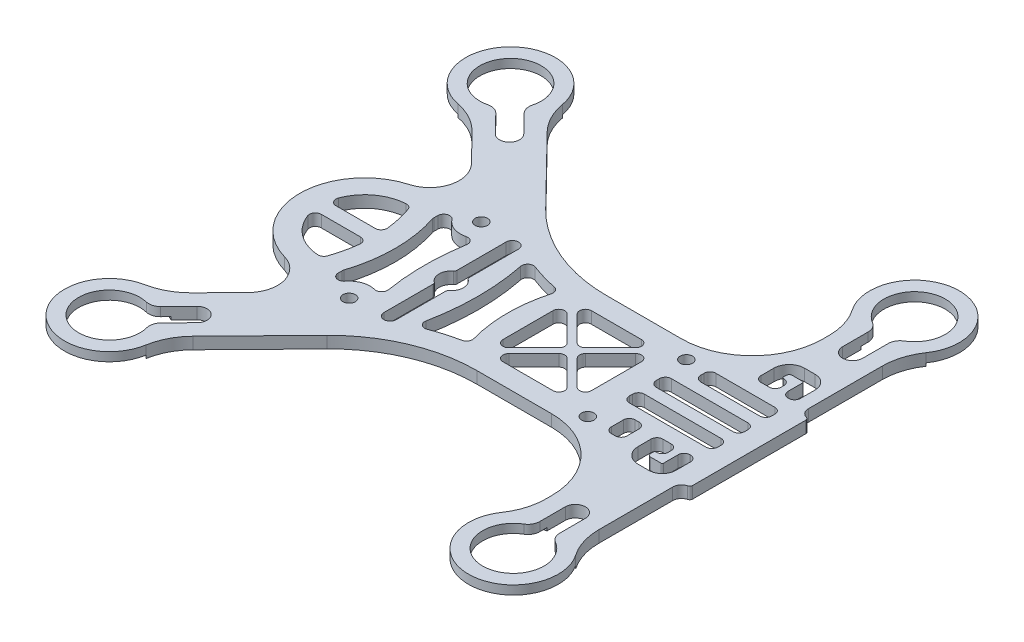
from build123d import *

# Parameters (mm, degrees)
ESQUISSE1_R             = 1.05
BOSS_EXTRU_1_DEPTH      = 2
ESQUISSE3_R             = 7.6
ENL_V_MAT_EXTRU_2_DEPTH = 0.5


with BuildPart() as part:
    # Esquisse1 → Boss.-Extru.1 (new body)
    with BuildSketch(Plane(origin=(0, 0, 0), x_dir=(1, 0, 0), z_dir=(0, 1, 0))):
        with BuildLine():
            Line((1810.142378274, 1227.688596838), (1821.387711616, 1216.191951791))
            ThreePointArc((1821.387711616, 1216.191951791), (1829.565086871, 1210.629428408), (1839.259638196, 1208.67320576))
            Line((1839.259638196, 1208.67320576), (1851.929794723, 1208.67320576))
            ThreePointArc((1851.929794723, 1208.67320576), (1860.415076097, 1212.187924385), (1863.929794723, 1220.67320576))
            Line((1863.929794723, 1220.67320576), (1863.929794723, 1221.697735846))
            ThreePointArc((1863.929794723, 1221.697735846), (1863.479306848, 1224.665364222), (1862.168431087, 1227.365616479))
            ThreePointArc((1862.168431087, 1227.365616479), (1868.429794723, 1239.27320576), (1874.691158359, 1227.365616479))
            ThreePointArc((1874.691158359, 1227.365616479), (1873.380282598, 1224.665364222), (1872.929794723, 1221.697735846))
            Line((1872.929794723, 1221.697735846), (1872.929794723, 1209.17320576))
            ThreePointArc((1872.929794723, 1209.17320576), (1873.235869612, 1208.265162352), (1874.029185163, 1207.727691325))
            ThreePointArc((1874.029185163, 1207.727691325), (1874.293623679, 1207.548534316), (1874.395648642, 1207.24585318))
            Line((1874.395648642, 1207.24585318), (1874.395648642, 1197.67320576))
            Line((1874.395648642, 1197.67320576), (1874.395648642, 1188.100558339))
            ThreePointArc((1874.395648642, 1188.100558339), (1874.293623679, 1187.797877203), (1874.029185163, 1187.618720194))
            ThreePointArc((1874.029185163, 1187.618720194), (1873.235869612, 1187.081249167), (1872.929794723, 1186.17320576))
            Line((1872.929794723, 1186.17320576), (1872.929794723, 1173.648675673))
            ThreePointArc((1872.929794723, 1173.648675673), (1873.380282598, 1170.681047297), (1874.691158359, 1167.98079504))
            ThreePointArc((1874.691158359, 1167.98079504), (1868.429794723, 1156.07320576), (1862.168431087, 1167.98079504))
            ThreePointArc((1862.168431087, 1167.98079504), (1863.479306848, 1170.681047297), (1863.929794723, 1173.648675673))
            Line((1863.929794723, 1173.648675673), (1863.929794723, 1174.67320576))
            ThreePointArc((1863.929794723, 1174.67320576), (1860.415076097, 1183.158487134), (1851.929794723, 1186.67320576))
            Line((1851.929794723, 1186.67320576), (1839.259638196, 1186.67320576))
            ThreePointArc((1839.259638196, 1186.67320576), (1829.565086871, 1184.716983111), (1821.387711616, 1179.154459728))
            Line((1821.387711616, 1179.154459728), (1810.142378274, 1167.657814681))
            ThreePointArc((1810.142378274, 1167.657814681), (1808.389307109, 1165.221321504), (1807.438270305, 1162.374343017))
            ThreePointArc((1807.438270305, 1162.374343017), (1794.635781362, 1158.240140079), (1798.486059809, 1171.130862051))
            ThreePointArc((1798.486059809, 1171.130862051), (1801.311326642, 1172.14458037), (1803.708484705, 1173.95106611))
            Line((1803.708484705, 1173.95106611), (1808.433485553, 1178.781661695))
            ThreePointArc((1808.433485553, 1178.781661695), (1809.690637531, 1183.564865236), (1806.220716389, 1187.088941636))
            ThreePointArc((1806.220716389, 1187.088941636), (1798.216271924, 1197.67320576), (1806.220716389, 1208.257469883))
            ThreePointArc((1806.220716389, 1208.257469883), (1809.690637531, 1211.781546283), (1808.433485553, 1216.564749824))
            Line((1808.433485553, 1216.564749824), (1803.708484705, 1221.395345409))
            ThreePointArc((1803.708484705, 1221.395345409), (1801.311326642, 1223.201831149), (1798.486059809, 1224.215549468))
            ThreePointArc((1798.486059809, 1224.215549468), (1794.635781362, 1237.10627144), (1807.438270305, 1232.972068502))
            ThreePointArc((1807.438270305, 1232.972068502), (1808.389307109, 1230.125090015), (1810.142378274, 1227.688596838))
        make_face()
        with Locations(Location((1855.395648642, 1189.32320576, 0), (0, 0, 270))):
            Circle(ESQUISSE1_R, mode=Mode.SUBTRACT)
        with Locations(Location((1855.395648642, 1206.02320576, 0), (0, 0, 270))):
            Circle(ESQUISSE1_R, mode=Mode.SUBTRACT)
        with Locations(Location((1817.795648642, 1186.47320576, 0), (0, 0, 270))):
            Circle(ESQUISSE1_R, mode=Mode.SUBTRACT)
        with Locations(Location((1817.795648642, 1208.87320576, 0), (0, 0, 270))):
            Circle(ESQUISSE1_R, mode=Mode.SUBTRACT)
        with BuildLine():
            Line((1870.129794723, 1169.849774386), (1870.129794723, 1174.17320576))
            ThreePointArc((1870.129794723, 1174.17320576), (1868.429794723, 1175.87320576), (1866.729794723, 1174.17320576))
            Line((1866.729794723, 1174.17320576), (1866.729794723, 1169.849774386))
            ThreePointArc((1866.729794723, 1169.849774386), (1866.469845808, 1168.863761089), (1865.757572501, 1168.134060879))
            ThreePointArc((1865.757572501, 1168.134060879), (1868.429794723, 1158.47320576), (1871.102016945, 1168.134060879))
            ThreePointArc((1871.102016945, 1168.134060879), (1870.389743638, 1168.863761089), (1870.129794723, 1169.849774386))
        make_face(mode=Mode.SUBTRACT)
        with BuildLine():
            Line((1803.053758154, 1169.27741827), (1806.076918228, 1172.368140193))
            ThreePointArc((1806.076918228, 1172.368140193), (1808.480934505, 1172.394705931), (1808.507500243, 1169.990689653))
            Line((1808.507500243, 1169.990689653), (1805.484340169, 1166.89996773))
            ThreePointArc((1805.484340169, 1166.89996773), (1804.980701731, 1166.01332012), (1804.979646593, 1164.993616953))
            ThreePointArc((1804.979646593, 1164.993616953), (1796.313981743, 1159.955845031), (1801.159025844, 1168.73072058))
            ThreePointArc((1801.159025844, 1168.73072058), (1802.178456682, 1168.7543093), (1803.053758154, 1169.27741827))
        make_face(mode=Mode.SUBTRACT)
        with BuildLine():
            Line((1870.129794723, 1225.496637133), (1870.129794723, 1221.17320576))
            ThreePointArc((1870.129794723, 1221.17320576), (1868.429794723, 1219.47320576), (1866.729794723, 1221.17320576))
            Line((1866.729794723, 1221.17320576), (1866.729794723, 1225.496637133))
            ThreePointArc((1866.729794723, 1225.496637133), (1866.469845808, 1226.48265043), (1865.757572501, 1227.21235064))
            ThreePointArc((1865.757572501, 1227.21235064), (1868.429794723, 1236.87320576), (1871.102016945, 1227.21235064))
            ThreePointArc((1871.102016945, 1227.21235064), (1870.389743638, 1226.48265043), (1870.129794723, 1225.496637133))
        make_face(mode=Mode.SUBTRACT)
        with BuildLine():
            Line((1803.053758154, 1226.068993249), (1806.076918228, 1222.978271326))
            ThreePointArc((1806.076918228, 1222.978271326), (1808.480934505, 1222.951705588), (1808.507500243, 1225.355721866))
            Line((1808.507500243, 1225.355721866), (1805.484340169, 1228.446443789))
            ThreePointArc((1805.484340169, 1228.446443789), (1804.980701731, 1229.333091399), (1804.979646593, 1230.352794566))
            ThreePointArc((1804.979646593, 1230.352794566), (1796.313981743, 1235.390566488), (1801.159025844, 1226.615690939))
            ThreePointArc((1801.159025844, 1226.615690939), (1802.178456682, 1226.592102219), (1803.053758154, 1226.068993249))
        make_face(mode=Mode.SUBTRACT)
        with BuildLine():
            Line((1864.056359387, 1212.190468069), (1864.056359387, 1210.007730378))
            ThreePointArc((1864.056359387, 1210.007730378), (1864.349252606, 1209.300623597), (1865.056359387, 1209.007730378))
            Line((1865.056359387, 1209.007730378), (1866.456359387, 1209.007730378))
            ThreePointArc((1866.456359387, 1209.007730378), (1867.163466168, 1209.300623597), (1867.456359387, 1210.007730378))
            Line((1867.456359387, 1210.007730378), (1867.456359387, 1210.490468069))
            ThreePointArc((1867.456359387, 1210.490468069), (1867.163466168, 1211.19757485), (1866.456359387, 1211.490468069))
            Line((1866.456359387, 1211.490468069), (1866.356359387, 1211.490468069))
            ThreePointArc((1866.356359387, 1211.490468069), (1866.214938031, 1211.549046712), (1866.156359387, 1211.690468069))
            Line((1866.156359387, 1211.690468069), (1866.156359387, 1212.190468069))
            ThreePointArc((1866.156359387, 1212.190468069), (1866.302805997, 1212.544021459), (1866.656359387, 1212.690468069))
            Line((1866.656359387, 1212.690468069), (1868.456359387, 1212.690468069))
            ThreePointArc((1868.456359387, 1212.690468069), (1868.597780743, 1212.631889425), (1868.656359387, 1212.490468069))
            Line((1868.656359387, 1212.490468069), (1868.656359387, 1210.007730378))
            ThreePointArc((1868.656359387, 1210.007730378), (1868.949252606, 1209.300623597), (1869.656359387, 1209.007730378))
            Line((1869.656359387, 1209.007730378), (1869.756359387, 1209.007730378))
            ThreePointArc((1869.756359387, 1209.007730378), (1870.463466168, 1209.300623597), (1870.756359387, 1210.007730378))
            Line((1870.756359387, 1210.007730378), (1870.756359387, 1212.490468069))
            ThreePointArc((1870.756359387, 1212.490468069), (1870.082704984, 1214.116813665), (1868.456359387, 1214.790468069))
            Line((1868.456359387, 1214.790468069), (1866.656359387, 1214.790468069))
            ThreePointArc((1866.656359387, 1214.790468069), (1864.817881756, 1214.0289457), (1864.056359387, 1212.190468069))
        make_face(mode=Mode.SUBTRACT)
        with BuildLine():
            Line((1864.056359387, 1189.190468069), (1864.056359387, 1191.37320576))
            ThreePointArc((1864.056359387, 1191.37320576), (1864.349252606, 1192.080312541), (1865.056359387, 1192.37320576))
            Line((1865.056359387, 1192.37320576), (1866.456359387, 1192.37320576))
            ThreePointArc((1866.456359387, 1192.37320576), (1867.163466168, 1192.080312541), (1867.456359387, 1191.37320576))
            Line((1867.456359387, 1191.37320576), (1867.456359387, 1190.890468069))
            ThreePointArc((1867.456359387, 1190.890468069), (1867.163466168, 1190.183361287), (1866.456359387, 1189.890468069))
            Line((1866.456359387, 1189.890468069), (1866.356359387, 1189.890468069))
            ThreePointArc((1866.356359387, 1189.890468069), (1866.214938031, 1189.831889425), (1866.156359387, 1189.690468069))
            Line((1866.156359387, 1189.690468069), (1866.156359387, 1189.190468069))
            ThreePointArc((1866.156359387, 1189.190468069), (1866.302805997, 1188.836914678), (1866.656359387, 1188.690468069))
            Line((1866.656359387, 1188.690468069), (1868.456359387, 1188.690468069))
            ThreePointArc((1868.456359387, 1188.690468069), (1868.597780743, 1188.749046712), (1868.656359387, 1188.890468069))
            Line((1868.656359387, 1188.890468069), (1868.656359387, 1191.37320576))
            ThreePointArc((1868.656359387, 1191.37320576), (1868.949252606, 1192.080312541), (1869.656359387, 1192.37320576))
            Line((1869.656359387, 1192.37320576), (1869.756359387, 1192.37320576))
            ThreePointArc((1869.756359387, 1192.37320576), (1870.463466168, 1192.080312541), (1870.756359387, 1191.37320576))
            Line((1870.756359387, 1191.37320576), (1870.756359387, 1188.890468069))
            ThreePointArc((1870.756359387, 1188.890468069), (1870.082704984, 1187.264122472), (1868.456359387, 1186.590468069))
            Line((1868.456359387, 1186.590468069), (1866.656359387, 1186.590468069))
            ThreePointArc((1866.656359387, 1186.590468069), (1864.817881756, 1187.351990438), (1864.056359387, 1189.190468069))
        make_face(mode=Mode.SUBTRACT)
        with BuildLine():
            Line((1840.158390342, 1190.17320576), (1848.632906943, 1190.17320576))
            ThreePointArc((1848.632906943, 1190.17320576), (1849.556786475, 1190.790522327), (1849.340013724, 1191.880312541))
            Line((1849.340013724, 1191.880312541), (1845.102755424, 1196.117570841))
            ThreePointArc((1845.102755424, 1196.117570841), (1844.395648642, 1196.41046406), (1843.688541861, 1196.117570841))
            Line((1843.688541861, 1196.117570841), (1839.451283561, 1191.880312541))
            ThreePointArc((1839.451283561, 1191.880312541), (1839.23451081, 1190.790522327), (1840.158390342, 1190.17320576))
        make_face(mode=Mode.SUBTRACT)
        with BuildLine():
            Line((1850.188541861, 1192.728840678), (1845.951283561, 1196.966098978))
            ThreePointArc((1845.951283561, 1196.966098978), (1845.658390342, 1197.67320576), (1845.951283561, 1198.380312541))
            Line((1845.951283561, 1198.380312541), (1850.188541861, 1202.617570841))
            ThreePointArc((1850.188541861, 1202.617570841), (1851.278332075, 1202.834343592), (1851.895648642, 1201.91046406))
            Line((1851.895648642, 1201.91046406), (1851.895648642, 1193.435947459))
            ThreePointArc((1851.895648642, 1193.435947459), (1851.278332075, 1192.512067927), (1850.188541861, 1192.728840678))
        make_face(mode=Mode.SUBTRACT)
        with BuildLine():
            Line((1840.158390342, 1205.17320576), (1848.632906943, 1205.17320576))
            ThreePointArc((1848.632906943, 1205.17320576), (1849.556786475, 1204.555889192), (1849.340013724, 1203.466098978))
            Line((1849.340013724, 1203.466098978), (1845.102755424, 1199.228840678))
            ThreePointArc((1845.102755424, 1199.228840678), (1844.395648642, 1198.935947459), (1843.688541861, 1199.228840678))
            Line((1843.688541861, 1199.228840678), (1839.451283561, 1203.466098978))
            ThreePointArc((1839.451283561, 1203.466098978), (1839.23451081, 1204.555889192), (1840.158390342, 1205.17320576))
        make_face(mode=Mode.SUBTRACT)
        with BuildLine():
            Line((1838.602755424, 1192.728840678), (1842.840013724, 1196.966098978))
            ThreePointArc((1842.840013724, 1196.966098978), (1843.132906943, 1197.67320576), (1842.840013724, 1198.380312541))
            Line((1842.840013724, 1198.380312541), (1838.602755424, 1202.617570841))
            ThreePointArc((1838.602755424, 1202.617570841), (1837.51296521, 1202.834343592), (1836.895648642, 1201.91046406))
            Line((1836.895648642, 1201.91046406), (1836.895648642, 1193.435947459))
            ThreePointArc((1836.895648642, 1193.435947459), (1837.51296521, 1192.512067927), (1838.602755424, 1192.728840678))
        make_face(mode=Mode.SUBTRACT)
        with BuildLine():
            Line((1870.895648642, 1200.410468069), (1870.895648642, 1200.970468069))
            ThreePointArc((1870.895648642, 1200.970468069), (1870.602755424, 1201.67757485), (1869.895648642, 1201.970468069))
            Line((1869.895648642, 1201.970468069), (1856.895648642, 1201.970468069))
            ThreePointArc((1856.895648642, 1201.970468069), (1856.188541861, 1201.67757485), (1855.895648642, 1200.970468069))
            Line((1855.895648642, 1200.970468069), (1855.895648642, 1200.410468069))
            ThreePointArc((1855.895648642, 1200.410468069), (1856.188541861, 1199.703361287), (1856.895648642, 1199.410468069))
            Line((1856.895648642, 1199.410468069), (1869.895648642, 1199.410468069))
            ThreePointArc((1869.895648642, 1199.410468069), (1870.602755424, 1199.703361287), (1870.895648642, 1200.410468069))
        make_face(mode=Mode.SUBTRACT)
        with BuildLine():
            Line((1870.895648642, 1195.850468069), (1870.895648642, 1196.410468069))
            ThreePointArc((1870.895648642, 1196.410468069), (1870.602755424, 1197.11757485), (1869.895648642, 1197.410468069))
            Line((1869.895648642, 1197.410468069), (1856.895648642, 1197.410468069))
            ThreePointArc((1856.895648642, 1197.410468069), (1856.188541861, 1197.11757485), (1855.895648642, 1196.410468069))
            Line((1855.895648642, 1196.410468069), (1855.895648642, 1195.850468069))
            ThreePointArc((1855.895648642, 1195.850468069), (1856.188541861, 1195.143361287), (1856.895648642, 1194.850468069))
            Line((1856.895648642, 1194.850468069), (1869.895648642, 1194.850468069))
            ThreePointArc((1869.895648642, 1194.850468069), (1870.602755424, 1195.143361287), (1870.895648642, 1195.850468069))
        make_face(mode=Mode.SUBTRACT)
        with BuildLine():
            Line((1870.895648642, 1205.530468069), (1870.895648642, 1204.970468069))
            ThreePointArc((1870.895648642, 1204.970468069), (1870.602755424, 1204.263361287), (1869.895648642, 1203.970468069))
            Line((1869.895648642, 1203.970468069), (1859.895648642, 1203.970468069))
            ThreePointArc((1859.895648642, 1203.970468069), (1859.188541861, 1204.263361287), (1858.895648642, 1204.970468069))
            Line((1858.895648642, 1204.970468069), (1858.895648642, 1205.530468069))
            ThreePointArc((1858.895648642, 1205.530468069), (1859.188541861, 1206.23757485), (1859.895648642, 1206.530468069))
            Line((1859.895648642, 1206.530468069), (1869.895648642, 1206.530468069))
            ThreePointArc((1869.895648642, 1206.530468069), (1870.602755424, 1206.23757485), (1870.895648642, 1205.530468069))
        make_face(mode=Mode.SUBTRACT)
        with BuildLine():
            Line((1861.556359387, 1191.850468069), (1861.556359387, 1189.81594345))
            ThreePointArc((1861.556359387, 1189.81594345), (1861.263466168, 1189.108836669), (1860.556359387, 1188.81594345))
            Line((1860.556359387, 1188.81594345), (1859.895648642, 1188.81594345))
            ThreePointArc((1859.895648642, 1188.81594345), (1859.188541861, 1189.108836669), (1858.895648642, 1189.81594345))
            Line((1858.895648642, 1189.81594345), (1858.895648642, 1191.850468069))
            ThreePointArc((1858.895648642, 1191.850468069), (1859.188541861, 1192.55757485), (1859.895648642, 1192.850468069))
            Line((1859.895648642, 1192.850468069), (1860.556359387, 1192.850468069))
            ThreePointArc((1860.556359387, 1192.850468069), (1861.263466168, 1192.55757485), (1861.556359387, 1191.850468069))
        make_face(mode=Mode.SUBTRACT)
        with BuildLine():
            Line((1824.945648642, 1199.698051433), (1824.945648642, 1208.028536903))
            ThreePointArc((1824.945648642, 1208.028536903), (1823.895648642, 1209.078536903), (1822.845648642, 1208.028536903))
            Line((1822.845648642, 1208.028536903), (1822.845648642, 1199.698051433))
            ThreePointArc((1822.845648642, 1199.698051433), (1822.79395701, 1199.476647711), (1822.649570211, 1199.301022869))
            ThreePointArc((1822.649570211, 1199.301022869), (1821.845648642, 1197.67320576), (1822.649570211, 1196.04538865))
            ThreePointArc((1822.649570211, 1196.04538865), (1822.79395701, 1195.869763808), (1822.845648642, 1195.648360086))
            Line((1822.845648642, 1195.648360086), (1822.845648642, 1187.317874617))
            ThreePointArc((1822.845648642, 1187.317874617), (1823.895648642, 1186.267874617), (1824.945648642, 1187.317874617))
            Line((1824.945648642, 1187.317874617), (1824.945648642, 1195.648360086))
            ThreePointArc((1824.945648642, 1195.648360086), (1824.997340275, 1195.869763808), (1825.141727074, 1196.04538865))
            ThreePointArc((1825.141727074, 1196.04538865), (1825.945648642, 1197.67320576), (1825.141727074, 1199.301022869))
            ThreePointArc((1825.141727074, 1199.301022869), (1824.997340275, 1199.476647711), (1824.945648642, 1199.698051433))
        make_face(mode=Mode.SUBTRACT)
        with BuildLine():
            Line((1813.17559704, 1189.887919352), (1813.17559704, 1189.229603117))
            ThreePointArc((1813.17559704, 1189.229603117), (1813.855921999, 1188.282075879), (1814.971212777, 1188.6238015))
            ThreePointArc((1814.971212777, 1188.6238015), (1816.621047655, 1189.823252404), (1818.6586698, 1189.916706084))
            ThreePointArc((1818.6586698, 1189.916706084), (1819.579289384, 1190.151197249), (1819.888433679, 1191.04950473))
            ThreePointArc((1819.888433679, 1191.04950473), (1819.345648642, 1197.67320576), (1819.888433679, 1204.296906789))
            ThreePointArc((1819.888433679, 1204.296906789), (1819.579289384, 1205.19521427), (1818.6586698, 1205.429705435))
            ThreePointArc((1818.6586698, 1205.429705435), (1816.621047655, 1205.523159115), (1814.971212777, 1206.722610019))
            ThreePointArc((1814.971212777, 1206.722610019), (1813.855921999, 1207.06433564), (1813.17559704, 1206.116808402))
            Line((1813.17559704, 1206.116808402), (1813.17559704, 1205.458492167))
            ThreePointArc((1813.17559704, 1205.458492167), (1813.187570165, 1205.304210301), (1813.223202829, 1205.153622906))
            ThreePointArc((1813.223202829, 1205.153622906), (1814.395144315, 1197.67320576), (1813.223202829, 1190.192788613))
            ThreePointArc((1813.223202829, 1190.192788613), (1813.187570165, 1190.042201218), (1813.17559704, 1189.887919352))
        make_face(mode=Mode.SUBTRACT)
        with BuildLine():
            Line((1803.118027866, 1196.423287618), (1809.76791415, 1196.423675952))
            ThreePointArc((1809.76791415, 1196.423675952), (1810.513843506, 1196.089766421), (1810.76160104, 1195.310970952))
            ThreePointArc((1810.76160104, 1195.310970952), (1810.380810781, 1193.058473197), (1809.757138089, 1190.860797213))
            ThreePointArc((1809.757138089, 1190.860797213), (1809.366727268, 1190.354170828), (1808.749150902, 1190.187766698))
            ThreePointArc((1808.749150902, 1190.187766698), (1804.738315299, 1191.656736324), (1802.179903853, 1195.077146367))
            ThreePointArc((1802.179903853, 1195.077146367), (1802.297660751, 1195.995041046), (1803.118027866, 1196.423287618))
        make_face(mode=Mode.SUBTRACT)
        with BuildLine():
            Line((1803.118027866, 1198.923123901), (1809.76791415, 1198.922735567))
            ThreePointArc((1809.76791415, 1198.922735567), (1810.513843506, 1199.256645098), (1810.76160104, 1200.035440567))
            ThreePointArc((1810.76160104, 1200.035440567), (1810.380810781, 1202.287938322), (1809.757138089, 1204.485614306))
            ThreePointArc((1809.757138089, 1204.485614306), (1809.366727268, 1204.992240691), (1808.749150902, 1205.158644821))
            ThreePointArc((1808.749150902, 1205.158644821), (1804.738315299, 1203.689675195), (1802.179903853, 1200.269265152))
            ThreePointArc((1802.179903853, 1200.269265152), (1802.297660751, 1199.351370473), (1803.118027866, 1198.923123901))
        make_face(mode=Mode.SUBTRACT)
        with BuildLine():
            ThreePointArc((1834.283905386, 1204.256026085), (1834.172391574, 1205.045028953), (1833.519624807, 1205.502037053))
            ThreePointArc((1833.519624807, 1205.502037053), (1831.225500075, 1206.068584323), (1828.985651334, 1206.821619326))
            ThreePointArc((1828.985651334, 1206.821619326), (1827.982659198, 1206.651296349), (1827.647902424, 1205.690598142))
            ThreePointArc((1827.647902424, 1205.690598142), (1828.445648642, 1197.67320576), (1827.647902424, 1189.655813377))
            ThreePointArc((1827.647902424, 1189.655813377), (1827.982659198, 1188.69511517), (1828.985651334, 1188.524792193))
            ThreePointArc((1828.985651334, 1188.524792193), (1831.23247681, 1189.279856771), (1833.533864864, 1189.847272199))
            ThreePointArc((1833.533864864, 1189.847272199), (1834.187557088, 1190.305083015), (1834.29806579, 1191.095457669))
            ThreePointArc((1834.29806579, 1191.095457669), (1833.3956469, 1197.674778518), (1834.283905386, 1204.256026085))
        make_face(mode=Mode.SUBTRACT)
    extrude(amount=BOSS_EXTRU_1_DEPTH)

    # Esquisse3 → Enl_v. mat.-Extru.2 (cut)
    with BuildSketch(Plane.XZ):
        with Locations((1799.950082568, -1163.67320576)):
            Circle(ESQUISSE3_R)
        with Locations((1868.429794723, -1163.67320576)):
            Circle(ESQUISSE3_R)
        with Locations((1799.950082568, -1231.67320576)):
            Circle(ESQUISSE3_R)
        with Locations((1868.429794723, -1231.67320576)):
            Circle(ESQUISSE3_R)
    extrude(amount=-ENL_V_MAT_EXTRU_2_DEPTH, mode=Mode.SUBTRACT)


solid = part.part
